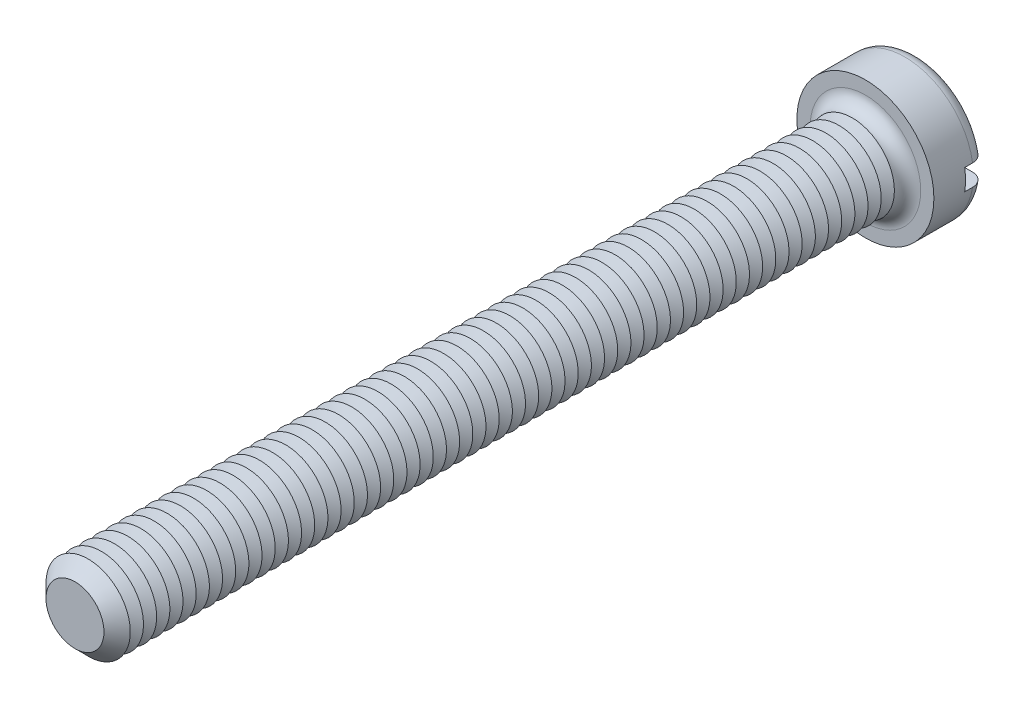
from build123d import *

# Parameters (mm, degrees)
SKETCH3_R           = 6.5
BOSS_EXTRUDE2_DEPTH = 5
SKETCH4_R           = 4
BOSS_EXTRUDE3_DEPTH = 75
FILLET1_R           = 1.25
CHAMFER1_SIZE       = 1.25
LPATTERN1_COUNT     = 58
LPATTERN1_PITCH     = 1.25
SKETCH8_W           = 13
SKETCH8_H           = 2
CUT_EXTRUDE1_DEPTH  = 2


with BuildPart() as part:
    # Sketch3 → Boss-Extrude2 (new body)
    with BuildSketch(Plane.XY):
        Circle(SKETCH3_R)
    extrude(amount=-BOSS_EXTRUDE2_DEPTH)

    # Sketch4 → Boss-Extrude3 (add)
    with BuildSketch(Plane.XY):
        Circle(SKETCH4_R)
    extrude(amount=BOSS_EXTRUDE3_DEPTH)

    # Fillet1
    fillet1_edges = [part.edges().sort_by_distance(p)[0] for p in [
        (-6.5, 0, -5),
        (-4, 0, 0),
    ]]
    fillet(fillet1_edges, radius=FILLET1_R)

    # Chamfer1
    chamfer1_edges = [part.edges().sort_by_distance(p)[0] for p in [
        (-4, 0, 75),
    ]]
    chamfer(chamfer1_edges, length=CHAMFER1_SIZE)

    # Sketch6 → Cut-Revolve1 (revolve, cut)
    with BuildSketch(Plane(origin=(0, 0, 0), x_dir=(0, 0, -1), z_dir=(1, 0, 0)), mode=Mode.PRIVATE) as cut_revolve1_sk:
        Polygon((-1.25, 4), (-1.875, 2.917468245), (-2.5, 4), align=None)
    cut_revolve1 = revolve(cut_revolve1_sk.sketch.rotate(Axis((0, 0, -1.694361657), (0, 0, 1)), 90), axis=Axis((0, 0, -1.694361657), (0, 0, 1)), mode=Mode.SUBTRACT)

    # LPattern1: Cut-Revolve1 ×58
    with Locations(*[(0, 0, i * LPATTERN1_PITCH) for i in range(1, LPATTERN1_COUNT)]):
        add(cut_revolve1, mode=Mode.SUBTRACT)

    # Sketch8 → Cut-Extrude1 (cut)
    with BuildSketch(Plane(origin=(0, 0, -5), x_dir=(-1, 0, 0), z_dir=(0, 0, -1))):
        Rectangle(SKETCH8_W, SKETCH8_H)
    extrude(amount=-CUT_EXTRUDE1_DEPTH, mode=Mode.SUBTRACT)


solid = part.part
